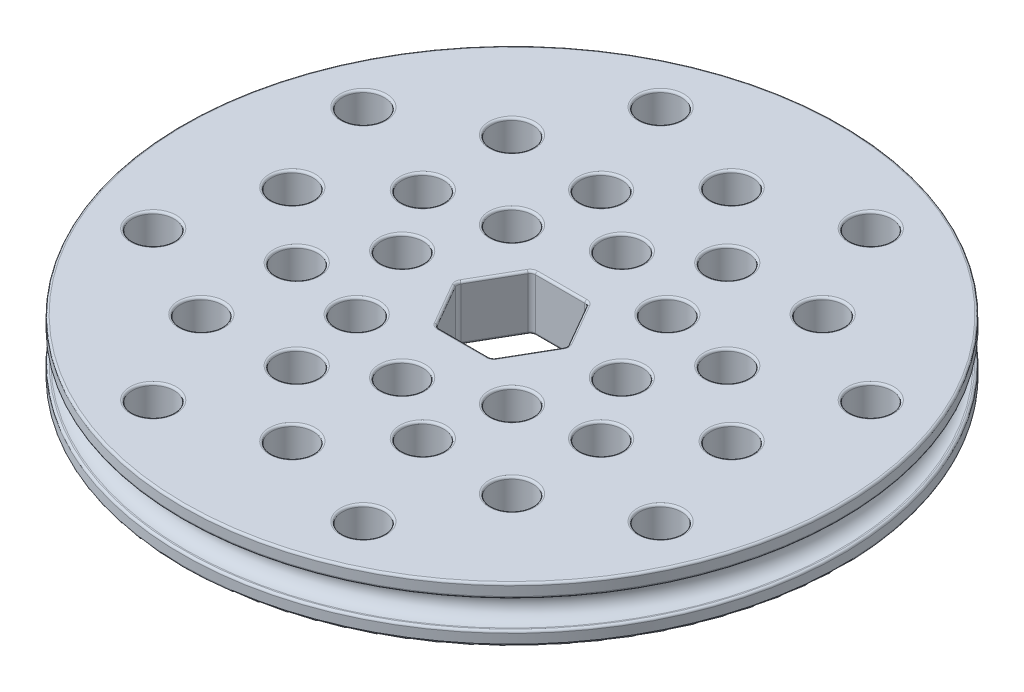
from build123d import *
from OCP.BRepFilletAPI import BRepFilletAPI_MakeFillet

# Parameters (mm, degrees)
SKETCH1_R          = 38.1
EXTRUDE1_DEPTH     = 6.35
SKETCH2_R          = 2.413
CUT_EXTRUDE1_DEPTH = 55.254423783
CIRPATTERN1_COUNT  = 8
FILLET1_R1         = 0.254
FILLET1_R2         = 0.635


with BuildPart() as part:
    # Sketch1 → Extrude1 (new body)
    with BuildSketch(Plane(origin=(0, 0, 0), x_dir=(1, 0, 0), z_dir=(0, 1, 0))):
        with Locations(Location((0, 0, 0), (0, 0, 270))):
            Circle(SKETCH1_R)
        Polygon((-6.423137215, 0), (-3.211568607, -5.5626), (3.211568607, -5.5626), (6.423137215, 0), (3.211568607, 5.5626), (-3.211568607, 5.5626), align=None, mode=Mode.SUBTRACT)
    extrude(amount=EXTRUDE1_DEPTH)

    # Sketch2 → Cut-Extrude1 (cut, through all)
    with BuildSketch(Plane(origin=(0, 6.35, 0), x_dir=(-1, 0, 0), z_dir=(0, 1, 0))):
        with Locations(Location((12.7, 0, 0), (0, 0, 90))):
            Circle(SKETCH2_R)
        with Locations(Location((25.4, 0, 0), (0, 0, 90))):
            Circle(SKETCH2_R)
        with Locations(Location((29.333175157, -12.150198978, 0), (0, 0, 90))):
            Circle(SKETCH2_R)
        with Locations(Location((17.599905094, -7.290119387, 0), (0, 0, 90))):
            Circle(SKETCH2_R)
    cut_extrude1 = extrude(amount=-CUT_EXTRUDE1_DEPTH, mode=Mode.SUBTRACT)

    # CirPattern1: Cut-Extrude1 ×8 about axis
    cirpattern1_axis = Axis((0, 0, 0), (0, 1, 0))
    for i in range(1, CIRPATTERN1_COUNT):
        add(cut_extrude1.rotate(cirpattern1_axis, i * 360 / CIRPATTERN1_COUNT), mode=Mode.SUBTRACT)

    # Sketch3 → Cut-Revolve1 (revolve, cut)
    with BuildSketch(Plane.XY, mode=Mode.PRIVATE) as cut_revolve1_sk:
        with BuildLine():
            Line((-38.1, 4.7625), (-37.703125, 4.7625))
            ThreePointArc((-37.703125, 4.7625), (-36.115625, 3.175), (-37.703125, 1.5875))
            Line((-37.703125, 1.5875), (-38.1, 1.5875))
            Line((-38.1, 1.5875), (-38.1, 4.7625))
        make_face()
    revolve(cut_revolve1_sk.sketch.rotate(Axis((0, 6.35, 0), (0, -1, 0)), 270), axis=Axis((0, 6.35, 0), (0, -1, 0)), mode=Mode.SUBTRACT)

    # Fillet1: one fillet with a radius per group of edges: ONE call of the kernel's fillet builder (fillet() takes one radius for all edges)
    fillet1_edges_1 = [part.edges().sort_by_distance(p)[0] for p in [
        (0, 0, 5.5626),
        (16.254263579, 6.35, 19.666760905),
        (16.254263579, 0, 19.666760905),
        (4.817352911, 0, 2.7813),
        (-2.413, 6.35, 25.4),
        (-2.413, 0, 25.4),
        (-19.666760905, 6.35, 16.254263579),
        (-19.666760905, 0, 16.254263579),
        (4.817352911, 0, -2.7813),
        (-10.443950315, 6.35, -31.03942382),
        (-10.443950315, 0, -31.03942382),
        (0, 0, -5.5626),
        (14.563198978, 6.35, -29.333175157),
        (14.563198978, 0, -29.333175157),
        (-4.817352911, 6.35, -2.7813),
        (31.03942382, 6.35, -10.443950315),
        (31.03942382, 0, -10.443950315),
        (-4.817352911, 6.35, 2.7813),
        (29.333175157, 6.35, 14.563198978),
        (29.333175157, 0, 14.563198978),
        (0, 6.35, 5.5626),
        (10.443950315, 6.35, 31.03942382),
        (10.443950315, 0, 31.03942382),
        (4.817352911, 6.35, 2.7813),
        (-14.563198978, 6.35, 29.333175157),
        (-14.563198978, 0, 29.333175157),
        (4.817352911, 6.35, -2.7813),
        (-31.03942382, 6.35, 10.443950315),
        (-31.03942382, 0, 10.443950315),
        (0, 6.35, -5.5626),
        (0, 1.5875, -38.1),
        (0, 4.7625, -38.1),
        (0, 0, -38.1),
        (-12.7, 0, -2.413),
        (-12.7, 6.35, -2.413),
        (-25.4, 0, -2.413),
        (-25.4, 6.35, -2.413),
        (-29.333175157, 0, -14.563198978),
        (-29.333175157, 6.35, -14.563198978),
        (-17.599905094, 0, -9.703119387),
        (-17.599905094, 6.35, -9.703119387),
        (0, 6.35, -38.1),
        (-5.583870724, 6.35, -19.306153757),
        (-5.583870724, 0, -19.306153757),
        (9.703119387, 6.35, -17.599905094),
        (9.703119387, 0, -17.599905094),
        (19.306153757, 6.35, -5.583870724),
        (19.306153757, 0, -5.583870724),
        (17.599905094, 6.35, 9.703119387),
        (17.599905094, 0, 9.703119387),
        (5.583870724, 6.35, 19.306153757),
        (5.583870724, 0, 19.306153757),
        (-9.703119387, 6.35, 17.599905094),
        (-9.703119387, 0, 17.599905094),
        (-19.306153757, 6.35, 5.583870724),
        (-19.306153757, 0, 5.583870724),
        (-7.274007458, 6.35, -10.686504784),
        (-7.274007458, 0, -10.686504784),
        (2.413, 6.35, -12.7),
        (2.413, 0, -12.7),
        (10.686504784, 6.35, -7.274007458),
        (10.686504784, 0, -7.274007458),
        (12.7, 6.35, 2.413),
        (12.7, 0, 2.413),
        (7.274007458, 6.35, 10.686504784),
        (7.274007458, 0, 10.686504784),
        (-2.413, 6.35, 12.7),
        (-2.413, 0, 12.7),
        (-10.686504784, 6.35, 7.274007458),
        (-10.686504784, 0, 7.274007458),
        (-16.254263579, 6.35, -19.666760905),
        (-16.254263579, 0, -19.666760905),
        (2.413, 6.35, -25.4),
        (2.413, 0, -25.4),
        (-4.817352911, 0, -2.7813),
        (19.666760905, 6.35, -16.254263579),
        (19.666760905, 0, -16.254263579),
        (-4.817352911, 0, 2.7813),
        (25.4, 6.35, 2.413),
        (25.4, 0, 2.413),
    ]]
    fillet1_edges_2 = [part.edges().sort_by_distance(p)[0] for p in [
        (-6.423137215, 3.175, 0),
        (-3.211568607, 3.175, 5.5626),
        (3.211568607, 3.175, 5.5626),
        (6.423137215, 3.175, 0),
        (3.211568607, 3.175, -5.5626),
        (-3.211568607, 3.175, -5.5626),
    ]]
    fillet1 = BRepFilletAPI_MakeFillet(part.part.solid().wrapped)
    for e in fillet1_edges_1:
        fillet1.Add(FILLET1_R1, e.wrapped)
    for e in fillet1_edges_2:
        fillet1.Add(FILLET1_R2, e.wrapped)
    add(Compound.cast(fillet1.Shape()), mode=Mode.REPLACE)


solid = part.part
